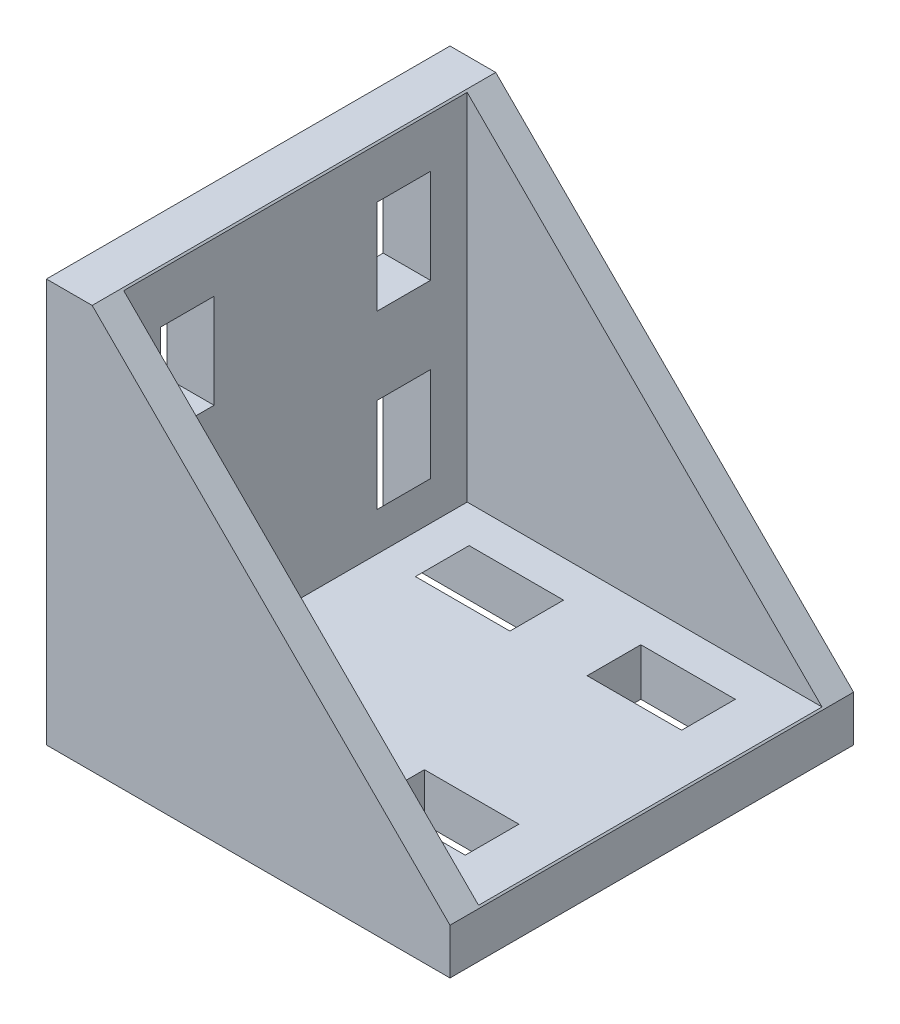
from build123d import *

# Parameters (mm, degrees)
BOSS_EXTRUDE1_DEPTH = 23.5
CUT_EXTRUDE1_DEPTH  = 20
CUT_EXTRUDE2_START  = 12.6
SKETCH3_W           = 5.5
SKETCH3_H           = 11
SKETCH3_W_2         = 11
SKETCH3_H_2         = 5.5
CUT_EXTRUDE2_DEPTH  = 3.125
BOSS_EXTRUDE2_START = 12.6
BOSS_EXTRUDE2_DEPTH = 3


with BuildPart() as part:
    # Sketch1 → Boss-Extrude1 (new, symmetric)
    with BuildSketch(Plane.XY):
        Polygon((0, 0), (0, 47), (5.325901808, 47), (47, 5.325901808), (47, 0), align=None)
    extrude(amount=BOSS_EXTRUDE1_DEPTH, both=True)

    # Sketch2 → Cut-Extrude1 (cut, symmetric)
    with BuildSketch(Plane.XY):
        Polygon((5.5, 46.825901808), (5.5, 5.5), (46.825901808, 5.5), align=None)
    extrude(amount=CUT_EXTRUDE1_DEPTH, both=True, mode=Mode.SUBTRACT)

    # Sketch3 → Cut-Extrude2 (cut, symmetric)
    with BuildSketch(Plane.XY.offset(CUT_EXTRUDE2_START)):
        Polygon((0, 21), (5.5, 21), (5.5, 10), (0, 4.5), align=None)
        Polygon((10, 5.5), (21, 5.5), (21, 0), (4.5, 0), align=None)
        with Locations((2.75, 35.5)):
            Rectangle(SKETCH3_W, SKETCH3_H)
        with Locations((35.5, 2.75)):
            Rectangle(SKETCH3_W_2, SKETCH3_H_2)
    cut_extrude2 = extrude(amount=CUT_EXTRUDE2_DEPTH, both=True, mode=Mode.SUBTRACT)

    # Sketch4 → Boss-Extrude2 (add, symmetric)
    with BuildSketch(Plane.XY.offset(BOSS_EXTRUDE2_START)):
        Polygon((0.748078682, -2.470468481), (-0.171019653, -1.536817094), (1.234750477, 0), (3.535533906, 0), align=None)
        Polygon((0, 3.535533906), (-2.470468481, 0.748078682), (-1.536817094, -0.171019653), (0, 1.234750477), align=None)
        Polygon((0, 46.3), (0, 43.999216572), (-1.536817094, 42.593446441), (-2.470468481, 43.512544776), align=None)
        Polygon((43.999216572, 0), (42.593446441, -1.536817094), (43.512544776, -2.470468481), (46.3, 0), align=None)
    boss_extrude2 = extrude(amount=BOSS_EXTRUDE2_DEPTH, both=True)

    # Mirror1: Cut-Extrude2, Boss-Extrude2 across plane
    add(cut_extrude2.mirror(Plane.XY), mode=Mode.SUBTRACT)
    add(boss_extrude2.mirror(Plane.XY))


solid = part.part
